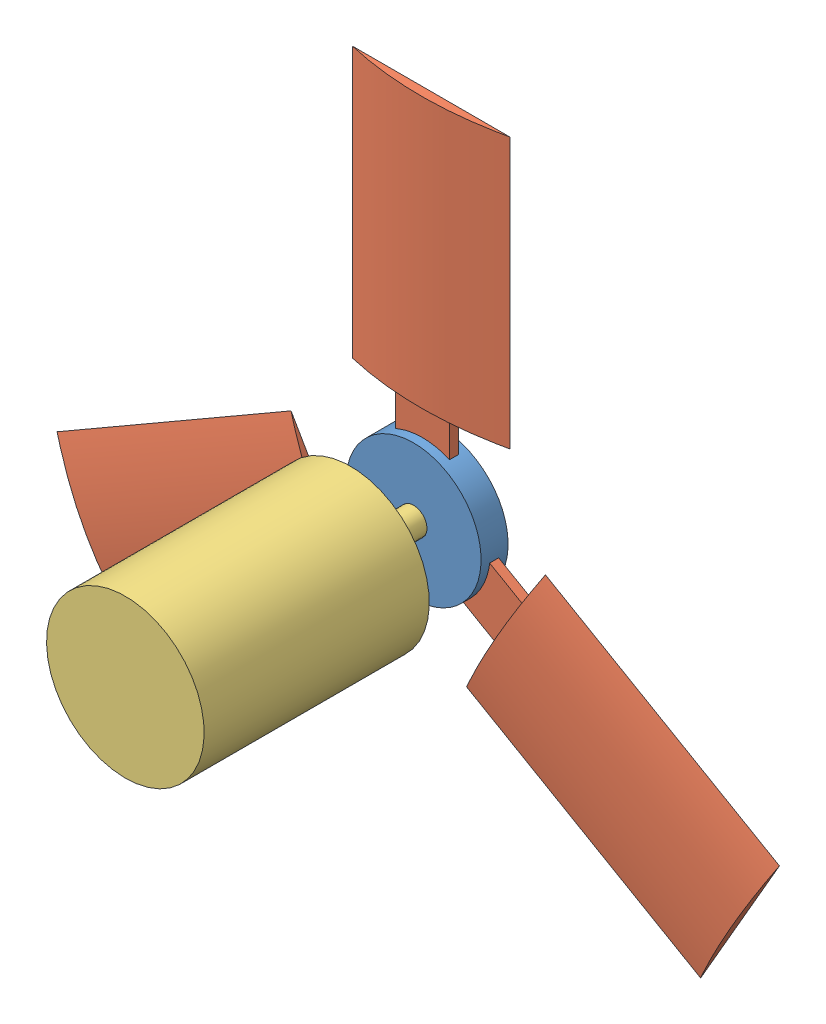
SolidWorks assembly VENTILADOR.SLDASM, configuration Predeterminado (file format 4400). Lengths in mm.
Overall size (802.09 702.85 523.73).
5 component instances, 3 part files, 4 mates.
Components (placement in the parent):
- masa alabe-1: masa alabe.SLDPRT [Predeterminado] at (-22.4004 21.0382 0) size (150 150 30)
- alabe-1: alabe.SLDPRT [Predeterminado] at (26.5901 -119.2443 20) x (0.485312 0.840585 -0.240603) z (0.866025 -0.5 0) size (169.86 42.11 372.57)
- alabe-2: alabe.SLDPRT [Predeterminado] at (74.5926 133.6064 20) x (-0.970623 0 -0.240603) z (0 1 0) size (169.86 42.11 372.57)
- alabe-3: alabe.SLDPRT [Predeterminado] at (-168.3838 48.7524 20) x (0.485312 -0.840585 -0.240603) z (-0.866025 -0.5 0) size (169.86 42.11 372.57)
- MOTOR 1.5 HP VENTILADOR-1: MOTOR 1.5 HP VENTILADOR.SLDPRT [Predeterminado] at (-22.4004 21.0382 350) x (0.027288 -0.999628 0) z (-0.999628 -0.027288 0) size (175 523.73 175)
Mates (geometry in assembly coordinates):
- Coincidente1: coincident anti-aligned: plane of masa alabe-1 through (27.2406 27.019 10) normal (0.866025 -0.5 0); plane of alabe-1 through (-2.7594 -24.9426 10) normal (-0.866025 0.5 0)
- Coincidente2: coincident anti-aligned: plane of masa alabe-1 through (51.3268 -56.1692 20) normal (0.5 0.866025 0); plane of alabe-1 through (118.4842 -94.9426 10) normal (-0.5 -0.866025 0)
- Coincidente3: coincident anti-aligned: plane of masa alabe-1 through (66.3268 -30.1884 10) normal (0 0 1); plane of alabe-1 through (27.2406 27.019 10) normal (0 0 -1)
- Coincidente4: coincident anti-aligned: circle of masa alabe-1; circle of MOTOR 1.5 HP VENTILADOR-1
